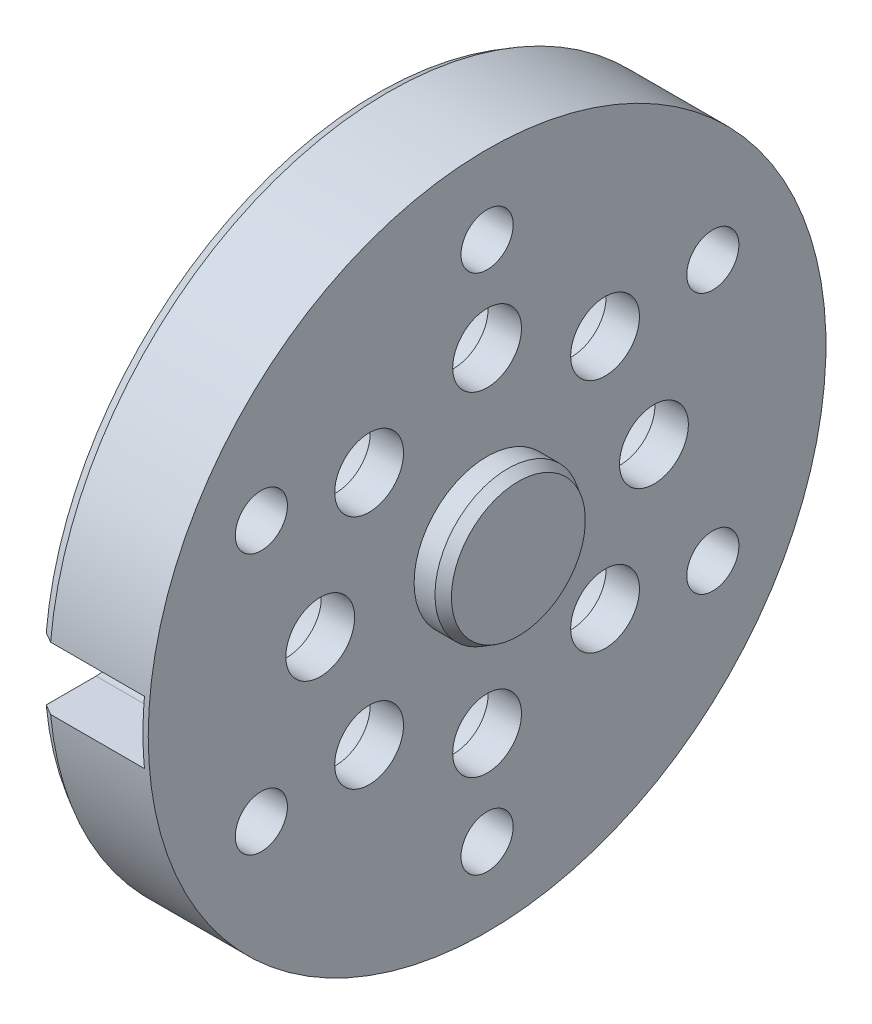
from build123d import *
from OCP.BRepFilletAPI import BRepFilletAPI_MakeChamfer

# Parameters (mm, degrees)
HOLE_WIZARD_M6_1_D        = 5
HOLE_WIZARD_4_0_4_1_D     = 4
HOLE_WIZARD_4_0_4_1_DEPTH = 4
HOLE_WIZARD_4_0_4_1_TIP   = 1.201721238
HOLE_WIZARD_1_D           = 6.6
HOLE_WIZARD_1_CBORE_D     = 11
HOLE_WIZARD_1_CBORE_DEPTH = 7.3
CUT_EXTRUDE_1_DEPTH       = 10
CHAMFER_1_SIZE            = 1
CHAMFER_1_SIZE2           = 0.577350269
CHAMFER_2_SIZE            = 1
CHAMFER_2_SIZE2           = 0.577350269
PATTERN_CIRCULAR_1_COUNT  = 8


with BuildPart() as part:
    # Sketch 1 → Revolve 1 (revolve)
    with BuildSketch(Plane.XY, mode=Mode.PRIVATE) as revolve_1_sk:
        Polygon((0, 32.5), (0, 9), (6, 9), (6, 0), (13.5, 0), (13.5, 7), (10.5, 7), (10.5, 32.5), align=None)
    revolve(revolve_1_sk.sketch.rotate(Axis((0, 0, 0), (1, 0, 0)), 90), axis=Axis((0, 0, 0), (1, 0, 0)))

    # Hole Wizard M6 _1 (through all)
    with Locations(Plane.ZY):
        with Locations((0, 25), (21.650635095, 12.5), (21.650635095, -12.5), (0, -25), (-21.650635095, -12.5), (-21.650635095, 12.5)):
            Hole(HOLE_WIZARD_M6_1_D / 2)

    # Hole Wizard 4.0 _4_ _1
    with Locations(Plane.ZY):
        with Locations((-25, 0)):
            Hole(HOLE_WIZARD_4_0_4_1_D / 2, depth=HOLE_WIZARD_4_0_4_1_DEPTH)
            with Locations((0, 0, -(HOLE_WIZARD_4_0_4_1_DEPTH + HOLE_WIZARD_4_0_4_1_TIP / 2))):  # 118° drill point
                Cone(0, HOLE_WIZARD_4_0_4_1_D / 2, HOLE_WIZARD_4_0_4_1_TIP, mode=Mode.SUBTRACT)

    # Hole Wizard 1 (through all)
    with Locations(Plane.ZY):
        with Locations((0, 16)):
            hole_wizard_1 = CounterBoreHole(HOLE_WIZARD_1_D / 2, HOLE_WIZARD_1_CBORE_D / 2, HOLE_WIZARD_1_CBORE_DEPTH)

    # Sketch 11 → Cut-Extrude 1 (cut)
    with BuildSketch(Plane.ZY):
        with BuildLine():
            Line((27, 3), (38.625848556, 3))
            Line((38.625848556, 3), (38.625848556, -3))
            Line((38.625848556, -3), (27, -3))
            ThreePointArc((27, -3), (24, 0), (27, 3))
        make_face()
    extrude(amount=-CUT_EXTRUDE_1_DEPTH, mode=Mode.SUBTRACT)

    # Chamfer 1: one chamfer whose edges measure the first distance from different faces: ONE call of the kernel's chamfer builder (chamfer() names one face for all edges)
    chamfer_1_edges_1 = [part.edges().sort_by_distance(p)[0] for p in [
        (0, 0, -32.5),
    ]]
    chamfer_1_side_1 = [part.faces().sort_by_distance(p)[0] for p in [
        (5.25, 0, -32.5),
    ]]
    chamfer_1_edges_2 = [part.edges().sort_by_distance(p)[0] for p in [
        (0, 0, -9),
    ]]
    chamfer_1_side_2 = [part.faces().sort_by_distance(p)[0] for p in [
        (3, 0, -9),
    ]]
    chamfer_1 = BRepFilletAPI_MakeChamfer(part.part.solid().wrapped)
    for e in chamfer_1_edges_1:
        chamfer_1.Add(CHAMFER_1_SIZE, CHAMFER_1_SIZE2, e.wrapped, chamfer_1_side_1[0].wrapped)  # the first distance lies on this face
    for e in chamfer_1_edges_2:
        chamfer_1.Add(CHAMFER_1_SIZE, CHAMFER_1_SIZE2, e.wrapped, chamfer_1_side_2[0].wrapped)  # the first distance lies on this face
    add(Compound.cast(chamfer_1.Shape()), mode=Mode.REPLACE)

    # Chamfer 2
    chamfer_2_edges = [part.edges().sort_by_distance(p)[0] for p in [
        (13.5, 0, -7),
    ]]
    chamfer_2_side = [part.faces().sort_by_distance(p)[0] for p in [
        (12, 0, -7),
    ]]
    chamfer(chamfer_2_edges, length=CHAMFER_2_SIZE, length2=CHAMFER_2_SIZE2, reference=chamfer_2_side[0])

    # Pattern Circular 1: Hole Wizard 1 ×8 about axis
    pattern_circular_1_axis = Axis((0, 0, 0), (1, 0, 0))
    for i in range(1, PATTERN_CIRCULAR_1_COUNT):
        add(hole_wizard_1.rotate(pattern_circular_1_axis, i * 360 / PATTERN_CIRCULAR_1_COUNT), mode=Mode.SUBTRACT)


solid = part.part
